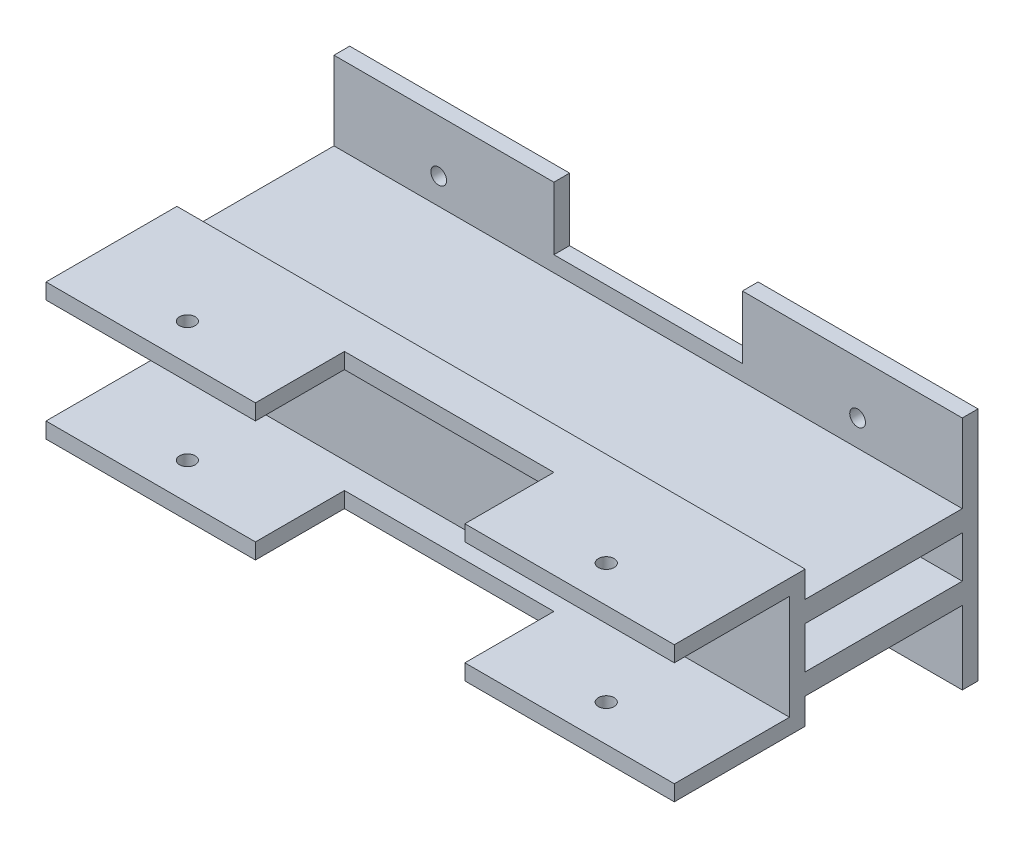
from build123d import *

# Parameters (mm, degrees)
SKETCH_1_W          = 200
SKETCH_1_H          = 25
EXTRUDE_1_DEPTH     = 3
SKETCH_2_W          = 200
SKETCH_2_H          = 3
EXTRUDE_2_DEPTH     = 20
SKETCH_3_W          = 200
SKETCH_3_H          = 25
EXTRUDE_4_DEPTH     = 3
CUT_EXTRUDE_1_REACH = 106.078
SKETCH_4_R          = 1.5
SKETCH_5_W          = 200
SKETCH_5_H          = 4
EXTRUDE_5_DEPTH     = 30
SKETCH_6_W          = 200
SKETCH_6_H          = 45
SKETCH_6_R          = 1.5
EXTRUDE_6_DEPTH     = 3
CUT_EXTRUDE_2_REACH = 117.305
SKETCH_7_W          = 40
SKETCH_7_H          = 17
CUT_EXTRUDE_3_DEPTH = 10
SKETCH_10_W         = 65.274594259
SKETCH_10_H         = 47.722559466
CUT_EXTRUDE_4_DEPTH = 90


with BuildPart() as part:
    # Sketch 1 → Extrude 1 (new body)
    with BuildSketch(Plane(origin=(0, 0, 0), x_dir=(1, 0, 0), z_dir=(0, 1, 0))):
        Rectangle(SKETCH_1_W, SKETCH_1_H)
    extrude(amount=EXTRUDE_1_DEPTH)

    # Sketch 2 → Extrude 2 (add)
    with BuildSketch(Plane.XZ):
        with Locations((0, -11)):
            Rectangle(SKETCH_2_W, SKETCH_2_H)
    extrude(amount=EXTRUDE_2_DEPTH)

    # Sketch 3 → Extrude 4 (add)
    with BuildSketch(Plane.XZ.offset(20)):
        Rectangle(SKETCH_3_W, SKETCH_3_H)
    extrude(amount=EXTRUDE_4_DEPTH)

    # Cut-Extrude 1: up to this face of the body (flat: up to its plane)
    cut_extrude_1_end = Plane(part.part.faces().sort_by_distance((0, -23, 0))[0])
    # Sketch 4 → Cut-Extrude 1 (cut, up to the picked face)
    with BuildSketch(Plane(origin=(0, 3, 0), x_dir=(1, 0, 0), z_dir=(0, 1, 0)), mode=Mode.PRIVATE) as cut_extrude_1_sk1:
        with Locations(Location((-80, -5.5, 0), (0, 0, 90))):
            Circle(SKETCH_4_R)
    cut_extrude_1_tool1 = split(extrude(cut_extrude_1_sk1.sketch, amount=-CUT_EXTRUDE_1_REACH, mode=Mode.PRIVATE), bisect_by=cut_extrude_1_end, keep=Keep.BOTH, mode=Mode.PRIVATE)
    # Sketch 4 → Cut-Extrude 1 (cut, up to the picked face)
    with BuildSketch(Plane(origin=(0, 3, 0), x_dir=(1, 0, 0), z_dir=(0, 1, 0)), mode=Mode.PRIVATE) as cut_extrude_1_sk2:
        with Locations(Location((-40, -5.5, 0), (0, 0, 90))):
            Circle(SKETCH_4_R)
    cut_extrude_1_tool2 = split(extrude(cut_extrude_1_sk2.sketch, amount=-CUT_EXTRUDE_1_REACH, mode=Mode.PRIVATE), bisect_by=cut_extrude_1_end, keep=Keep.BOTH, mode=Mode.PRIVATE)
    # Sketch 4 → Cut-Extrude 1 (cut, up to the picked face)
    with BuildSketch(Plane(origin=(0, 3, 0), x_dir=(1, 0, 0), z_dir=(0, 1, 0)), mode=Mode.PRIVATE) as cut_extrude_1_sk3:
        with Locations(Location((0, -5.5, 0), (0, 0, 90))):
            Circle(SKETCH_4_R)
    cut_extrude_1_tool3 = split(extrude(cut_extrude_1_sk3.sketch, amount=-CUT_EXTRUDE_1_REACH, mode=Mode.PRIVATE), bisect_by=cut_extrude_1_end, keep=Keep.BOTH, mode=Mode.PRIVATE)
    # Sketch 4 → Cut-Extrude 1 (cut, up to the picked face)
    with BuildSketch(Plane(origin=(0, 3, 0), x_dir=(1, 0, 0), z_dir=(0, 1, 0)), mode=Mode.PRIVATE) as cut_extrude_1_sk4:
        with Locations(Location((40, -5.5, 0), (0, 0, 90))):
            Circle(SKETCH_4_R)
    cut_extrude_1_tool4 = split(extrude(cut_extrude_1_sk4.sketch, amount=-CUT_EXTRUDE_1_REACH, mode=Mode.PRIVATE), bisect_by=cut_extrude_1_end, keep=Keep.BOTH, mode=Mode.PRIVATE)
    # Sketch 4 → Cut-Extrude 1 (cut, up to the picked face)
    with BuildSketch(Plane(origin=(0, 3, 0), x_dir=(1, 0, 0), z_dir=(0, 1, 0)), mode=Mode.PRIVATE) as cut_extrude_1_sk5:
        with Locations(Location((80, -5.5, 0), (0, 0, 90))):
            Circle(SKETCH_4_R)
    cut_extrude_1_tool5 = split(extrude(cut_extrude_1_sk5.sketch, amount=-CUT_EXTRUDE_1_REACH, mode=Mode.PRIVATE), bisect_by=cut_extrude_1_end, keep=Keep.BOTH, mode=Mode.PRIVATE)
    add(cut_extrude_1_tool1.solids().sort_by(Axis((-80, 3, 5.5), (0, -1, 0)))[0], mode=Mode.SUBTRACT)
    add(cut_extrude_1_tool2.solids().sort_by(Axis((-40, 3, 5.5), (0, -1, 0)))[0], mode=Mode.SUBTRACT)
    add(cut_extrude_1_tool3.solids().sort_by(Axis((0, 3, 5.5), (0, -1, 0)))[0], mode=Mode.SUBTRACT)
    add(cut_extrude_1_tool4.solids().sort_by(Axis((40, 3, 5.5), (0, -1, 0)))[0], mode=Mode.SUBTRACT)
    add(cut_extrude_1_tool5.solids().sort_by(Axis((80, 3, 5.5), (0, -1, 0)))[0], mode=Mode.SUBTRACT)

    # Sketch 5 → Extrude 5 (add)
    with BuildSketch(Plane(origin=(0, 0, -12.5), x_dir=(-1, 0, 0), z_dir=(0, 0, -1))):
        with Locations((0, -4)):
            Rectangle(SKETCH_5_W, SKETCH_5_H)
        with Locations((0, -16)):
            Rectangle(SKETCH_5_W, SKETCH_5_H)
    extrude(amount=EXTRUDE_5_DEPTH)

    # Sketch 6 → Extrude 6 (add)
    with BuildSketch(Plane(origin=(0, 0, -42.5), x_dir=(-1, 0, 0), z_dir=(0, 0, -1))):
        with Locations((0, -9.5)):
            Rectangle(SKETCH_6_W, SKETCH_6_H)
        with Locations((-80, 3)):
            Circle(SKETCH_6_R, mode=Mode.SUBTRACT)
        with Locations((-80, -23)):
            Circle(SKETCH_6_R, mode=Mode.SUBTRACT)
        with Locations((-40, 3)):
            Circle(SKETCH_6_R, mode=Mode.SUBTRACT)
        with Locations((-40, -23)):
            Circle(SKETCH_6_R, mode=Mode.SUBTRACT)
        with Locations((0, 3)):
            Circle(SKETCH_6_R, mode=Mode.SUBTRACT)
        with Locations((0, -23)):
            Circle(SKETCH_6_R, mode=Mode.SUBTRACT)
        with Locations((40, 3)):
            Circle(SKETCH_6_R, mode=Mode.SUBTRACT)
        with Locations((40, -23)):
            Circle(SKETCH_6_R, mode=Mode.SUBTRACT)
        with Locations((80, 3)):
            Circle(SKETCH_6_R, mode=Mode.SUBTRACT)
        with Locations((80, -23)):
            Circle(SKETCH_6_R, mode=Mode.SUBTRACT)
    extrude(amount=EXTRUDE_6_DEPTH)

    # Cut-Extrude 2: up to this face of the body (flat: up to its plane)
    cut_extrude_2_end = Plane(part.part.faces().sort_by_distance((0, -23, -0.039153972))[0])
    # Sketch 7 → Cut-Extrude 2 (cut, up to the picked face)
    with BuildSketch(Plane(origin=(0, 3, 0), x_dir=(1, 0, 0), z_dir=(0, 1, 0)), mode=Mode.PRIVATE) as cut_extrude_2_sk1:
        with Locations((-40, -4)):
            Rectangle(SKETCH_7_W, SKETCH_7_H)
    cut_extrude_2_tool1 = split(extrude(cut_extrude_2_sk1.sketch, amount=-CUT_EXTRUDE_2_REACH, mode=Mode.PRIVATE), bisect_by=cut_extrude_2_end, keep=Keep.BOTH, mode=Mode.PRIVATE)
    # Sketch 7 → Cut-Extrude 2 (cut, up to the picked face)
    with BuildSketch(Plane(origin=(0, 3, 0), x_dir=(1, 0, 0), z_dir=(0, 1, 0)), mode=Mode.PRIVATE) as cut_extrude_2_sk2:
        with Locations((40, -4)):
            Rectangle(SKETCH_7_W, SKETCH_7_H)
    cut_extrude_2_tool2 = split(extrude(cut_extrude_2_sk2.sketch, amount=-CUT_EXTRUDE_2_REACH, mode=Mode.PRIVATE), bisect_by=cut_extrude_2_end, keep=Keep.BOTH, mode=Mode.PRIVATE)
    add(cut_extrude_2_tool1.solids().sort_by(Axis((-40, 3, 4), (0, -1, 0)))[0], mode=Mode.SUBTRACT)
    add(cut_extrude_2_tool2.solids().sort_by(Axis((40, 3, 4), (0, -1, 0)))[0], mode=Mode.SUBTRACT)

    # Sketch 9 → Cut-Extrude 3 (cut)
    with BuildSketch(Plane(origin=(0, 0, -45.5), x_dir=(-1, 0, 0), z_dir=(0, 0, -1))):
        Polygon((22, 1), (58, 1), (58, 13), (40, 13), (22, 13), align=None)
        Polygon((22, -20), (22, -32), (58, -32), (58, -20), (40, -20), align=None)
    extrude(amount=-CUT_EXTRUDE_3_DEPTH, mode=Mode.SUBTRACT)

    # Sketch 10 → Cut-Extrude 4 (cut)
    with BuildSketch(Plane(origin=(20, 0, 0), x_dir=(0, 0, -1), z_dir=(1, 0, 0))):
        with Locations((15.21917584, -9.903222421)):
            Rectangle(SKETCH_10_W, SKETCH_10_H)
    extrude(amount=CUT_EXTRUDE_4_DEPTH, mode=Mode.SUBTRACT)


solid = part.part
